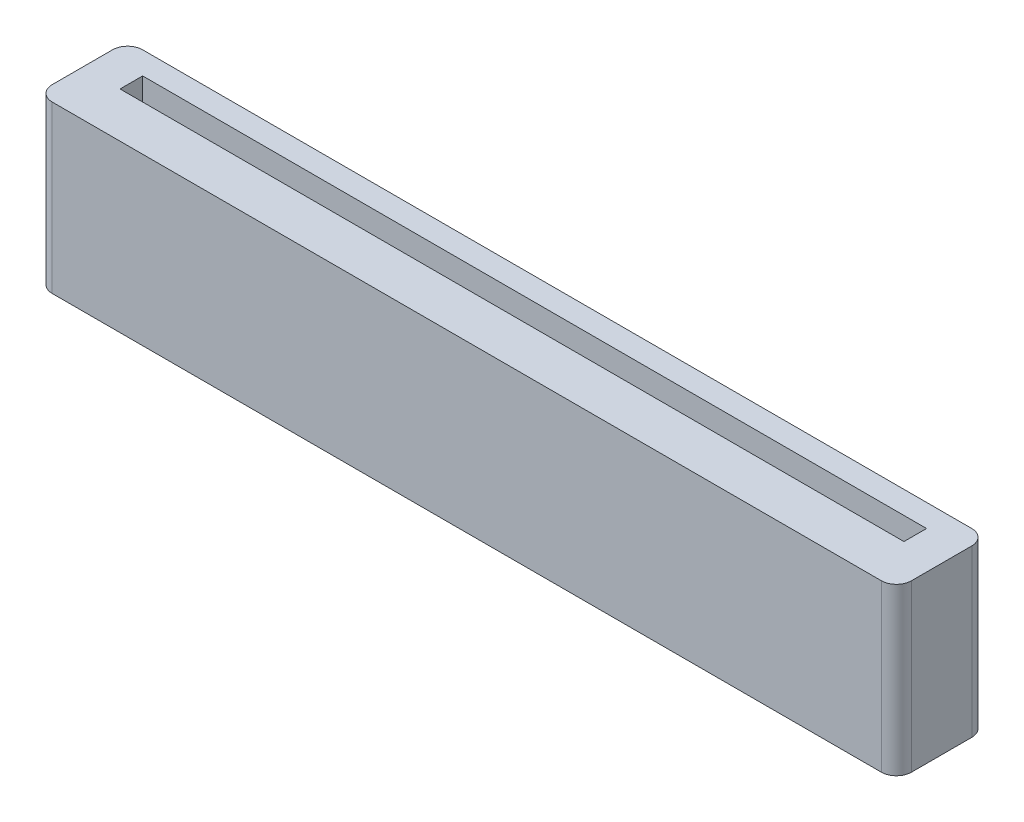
ISO-10303-21;
HEADER;
FILE_DESCRIPTION(('STEP AP214'),'2;1');
FILE_NAME('part.step','',(''),(''),'','','');
FILE_SCHEMA(('AUTOMOTIVE_DESIGN { 1 0 10303 214 1 1 1 1 }'));
ENDSEC;
DATA;
#1=APPLICATION_CONTEXT('core data for automotive mechanical design processes');
#2=APPLICATION_PROTOCOL_DEFINITION('international standard','automotive_design',2000,#1);
#3=PRODUCT_CONTEXT('',#1,'mechanical');
#4=PRODUCT('Part','Part','',(#3));
#5=PRODUCT_RELATED_PRODUCT_CATEGORY('part','',(#4));
#6=PRODUCT_DEFINITION_FORMATION('','',#4);
#7=PRODUCT_DEFINITION_CONTEXT('part definition',#1,'design');
#8=PRODUCT_DEFINITION('design','',#6,#7);
#9=PRODUCT_DEFINITION_SHAPE('','',#8);
#10=(LENGTH_UNIT() NAMED_UNIT(*) SI_UNIT(.MILLI.,.METRE.));
#11=(NAMED_UNIT(*) PLANE_ANGLE_UNIT() SI_UNIT($,.RADIAN.));
#12=(NAMED_UNIT(*) SI_UNIT($,.STERADIAN.) SOLID_ANGLE_UNIT());
#13=UNCERTAINTY_MEASURE_WITH_UNIT(LENGTH_MEASURE(1.E-05),#10,'distance_accuracy_value','');
#14=(GEOMETRIC_REPRESENTATION_CONTEXT(3) GLOBAL_UNCERTAINTY_ASSIGNED_CONTEXT((#13)) GLOBAL_UNIT_ASSIGNED_CONTEXT((#10,
#11,#12)) REPRESENTATION_CONTEXT('',''));
#15=CARTESIAN_POINT('',(0.,0.,0.));
#16=DIRECTION('',(0.,0.,1.));
#17=DIRECTION('',(1.,0.,0.));
#18=AXIS2_PLACEMENT_3D('',#15,#16,#17);
#19=CARTESIAN_POINT('',(27.5,11.,-2.));
#20=DIRECTION('',(0.,-1.,0.));
#21=DIRECTION('',(0.,0.,-1.));
#22=AXIS2_PLACEMENT_3D('',#19,#20,#21);
#23=CYLINDRICAL_SURFACE('',#22,1.);
#24=CARTESIAN_POINT('',(27.5,0.,-2.));
#25=DIRECTION('',(0.,1.,0.));
#26=DIRECTION('',(0.,0.,-1.));
#27=AXIS2_PLACEMENT_3D('',#24,#25,#26);
#28=CIRCLE('',#27,1.);
#29=CARTESIAN_POINT('',(28.5,0.,-1.99999999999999));
#30=VERTEX_POINT('',#29);
#31=CARTESIAN_POINT('',(27.5,0.,-3.));
#32=VERTEX_POINT('',#31);
#33=EDGE_CURVE('E146',#30,#32,#28,.T.);
#34=ORIENTED_EDGE('',*,*,#33,.T.);
#35=DIRECTION('',(0.,-1.,0.));
#36=VECTOR('',#35,1.);
#37=CARTESIAN_POINT('',(27.5,11.,-3.));
#38=LINE('',#37,#36);
#39=CARTESIAN_POINT('',(27.5,11.,-3.));
#40=VERTEX_POINT('',#39);
#41=EDGE_CURVE('E11',#40,#32,#38,.T.);
#42=ORIENTED_EDGE('',*,*,#41,.F.);
#43=CARTESIAN_POINT('',(27.5,11.,-2.));
#44=DIRECTION('',(0.,1.,0.));
#45=DIRECTION('',(0.,0.,-1.));
#46=AXIS2_PLACEMENT_3D('',#43,#44,#45);
#47=CIRCLE('',#46,1.);
#48=CARTESIAN_POINT('',(28.5,11.,-1.99999999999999));
#49=VERTEX_POINT('',#48);
#50=EDGE_CURVE('E162',#49,#40,#47,.T.);
#51=ORIENTED_EDGE('',*,*,#50,.F.);
#52=DIRECTION('',(0.,-1.,0.));
#53=VECTOR('',#52,1.);
#54=CARTESIAN_POINT('',(28.5,11.,-1.99999999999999));
#55=LINE('',#54,#53);
#56=EDGE_CURVE('E142',#49,#30,#55,.T.);
#57=ORIENTED_EDGE('',*,*,#56,.T.);
#58=EDGE_LOOP('',(#34,#42,#51,#57));
#59=FACE_BOUND('',#58,.T.);
#60=ADVANCED_FACE('F38',(#59),#23,.T.);
#61=CARTESIAN_POINT('',(-27.5,11.,-3.));
#62=DIRECTION('',(0.,0.,1.));
#63=DIRECTION('',(1.,0.,0.));
#64=AXIS2_PLACEMENT_3D('',#61,#62,#63);
#65=PLANE('',#64);
#66=DIRECTION('',(-1.,0.,0.));
#67=VECTOR('',#66,1.);
#68=CARTESIAN_POINT('',(-27.5,0.,-3.));
#69=LINE('',#68,#67);
#70=CARTESIAN_POINT('',(-27.5,0.,-3.));
#71=VERTEX_POINT('',#70);
#72=EDGE_CURVE('E149',#32,#71,#69,.T.);
#73=ORIENTED_EDGE('',*,*,#72,.T.);
#74=DIRECTION('',(0.,-1.,0.));
#75=VECTOR('',#74,1.);
#76=CARTESIAN_POINT('',(-27.5,11.,-3.));
#77=LINE('',#76,#75);
#78=CARTESIAN_POINT('',(-27.5,11.,-3.));
#79=VERTEX_POINT('',#78);
#80=EDGE_CURVE('E45',#79,#71,#77,.T.);
#81=ORIENTED_EDGE('',*,*,#80,.F.);
#82=DIRECTION('',(-1.,0.,0.));
#83=VECTOR('',#82,1.);
#84=CARTESIAN_POINT('',(-27.5,11.,-3.));
#85=LINE('',#84,#83);
#86=EDGE_CURVE('E102',#40,#79,#85,.T.);
#87=ORIENTED_EDGE('',*,*,#86,.F.);
#88=ORIENTED_EDGE('',*,*,#41,.T.);
#89=EDGE_LOOP('',(#73,#81,#87,#88));
#90=FACE_BOUND('',#89,.T.);
#91=ADVANCED_FACE('F265',(#90),#65,.F.);
#92=CARTESIAN_POINT('',(-27.5,11.,-2.));
#93=DIRECTION('',(0.,-1.,0.));
#94=DIRECTION('',(0.,0.,-1.));
#95=AXIS2_PLACEMENT_3D('',#92,#93,#94);
#96=CYLINDRICAL_SURFACE('',#95,1.);
#97=CARTESIAN_POINT('',(-27.5,0.,-2.));
#98=DIRECTION('',(0.,1.,0.));
#99=DIRECTION('',(0.,0.,1.));
#100=AXIS2_PLACEMENT_3D('',#97,#98,#99);
#101=CIRCLE('',#100,1.);
#102=CARTESIAN_POINT('',(-28.5,0.,-1.99999999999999));
#103=VERTEX_POINT('',#102);
#104=EDGE_CURVE('E152',#71,#103,#101,.T.);
#105=ORIENTED_EDGE('',*,*,#104,.T.);
#106=DIRECTION('',(0.,-1.,0.));
#107=VECTOR('',#106,1.);
#108=CARTESIAN_POINT('',(-28.5,11.,-1.99999999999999));
#109=LINE('',#108,#107);
#110=CARTESIAN_POINT('',(-28.5,11.,-1.99999999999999));
#111=VERTEX_POINT('',#110);
#112=EDGE_CURVE('E169',#111,#103,#109,.T.);
#113=ORIENTED_EDGE('',*,*,#112,.F.);
#114=CARTESIAN_POINT('',(-27.5,11.,-2.));
#115=DIRECTION('',(0.,1.,0.));
#116=DIRECTION('',(0.,0.,1.));
#117=AXIS2_PLACEMENT_3D('',#114,#115,#116);
#118=CIRCLE('',#117,1.);
#119=EDGE_CURVE('E177',#79,#111,#118,.T.);
#120=ORIENTED_EDGE('',*,*,#119,.F.);
#121=ORIENTED_EDGE('',*,*,#80,.T.);
#122=EDGE_LOOP('',(#105,#113,#120,#121));
#123=FACE_BOUND('',#122,.T.);
#124=ADVANCED_FACE('F175',(#123),#96,.T.);
#125=CARTESIAN_POINT('',(-28.5,11.,-1.99999999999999));
#126=DIRECTION('',(1.,0.,0.));
#127=DIRECTION('',(0.,0.,-1.));
#128=AXIS2_PLACEMENT_3D('',#125,#126,#127);
#129=PLANE('',#128);
#130=DIRECTION('',(0.,0.,1.));
#131=VECTOR('',#130,1.);
#132=CARTESIAN_POINT('',(-28.5,0.,-1.99999999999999));
#133=LINE('',#132,#131);
#134=CARTESIAN_POINT('',(-28.5,0.,1.99999999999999));
#135=VERTEX_POINT('',#134);
#136=EDGE_CURVE('E154',#103,#135,#133,.T.);
#137=ORIENTED_EDGE('',*,*,#136,.T.);
#138=DIRECTION('',(0.,-1.,0.));
#139=VECTOR('',#138,1.);
#140=CARTESIAN_POINT('',(-28.5,11.,1.99999999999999));
#141=LINE('',#140,#139);
#142=CARTESIAN_POINT('',(-28.5,11.,1.99999999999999));
#143=VERTEX_POINT('',#142);
#144=EDGE_CURVE('E166',#143,#135,#141,.T.);
#145=ORIENTED_EDGE('',*,*,#144,.F.);
#146=DIRECTION('',(0.,0.,1.));
#147=VECTOR('',#146,1.);
#148=CARTESIAN_POINT('',(-28.5,11.,-1.99999999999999));
#149=LINE('',#148,#147);
#150=EDGE_CURVE('E189',#111,#143,#149,.T.);
#151=ORIENTED_EDGE('',*,*,#150,.F.);
#152=ORIENTED_EDGE('',*,*,#112,.T.);
#153=EDGE_LOOP('',(#137,#145,#151,#152));
#154=FACE_BOUND('',#153,.T.);
#155=ADVANCED_FACE('F185',(#154),#129,.F.);
#156=CARTESIAN_POINT('',(-27.5,11.,2.));
#157=DIRECTION('',(0.,-1.,0.));
#158=DIRECTION('',(0.,0.,-1.));
#159=AXIS2_PLACEMENT_3D('',#156,#157,#158);
#160=CYLINDRICAL_SURFACE('',#159,1.);
#161=CARTESIAN_POINT('',(-27.5,0.,2.));
#162=DIRECTION('',(0.,1.,0.));
#163=DIRECTION('',(0.,0.,1.));
#164=AXIS2_PLACEMENT_3D('',#161,#162,#163);
#165=CIRCLE('',#164,1.);
#166=CARTESIAN_POINT('',(-27.5,0.,3.));
#167=VERTEX_POINT('',#166);
#168=EDGE_CURVE('E156',#135,#167,#165,.T.);
#169=ORIENTED_EDGE('',*,*,#168,.T.);
#170=DIRECTION('',(0.,-1.,0.));
#171=VECTOR('',#170,1.);
#172=CARTESIAN_POINT('',(-27.5,11.,3.));
#173=LINE('',#172,#171);
#174=CARTESIAN_POINT('',(-27.5,11.,3.));
#175=VERTEX_POINT('',#174);
#176=EDGE_CURVE('E137',#175,#167,#173,.T.);
#177=ORIENTED_EDGE('',*,*,#176,.F.);
#178=CARTESIAN_POINT('',(-27.5,11.,2.));
#179=DIRECTION('',(0.,1.,0.));
#180=DIRECTION('',(0.,0.,1.));
#181=AXIS2_PLACEMENT_3D('',#178,#179,#180);
#182=CIRCLE('',#181,1.);
#183=EDGE_CURVE('E125',#143,#175,#182,.T.);
#184=ORIENTED_EDGE('',*,*,#183,.F.);
#185=ORIENTED_EDGE('',*,*,#144,.T.);
#186=EDGE_LOOP('',(#169,#177,#184,#185));
#187=FACE_BOUND('',#186,.T.);
#188=ADVANCED_FACE('F188',(#187),#160,.T.);
#189=CARTESIAN_POINT('',(-27.5,11.,3.));
#190=DIRECTION('',(0.,0.,-1.));
#191=DIRECTION('',(-1.,0.,0.));
#192=AXIS2_PLACEMENT_3D('',#189,#190,#191);
#193=PLANE('',#192);
#194=DIRECTION('',(1.,0.,0.));
#195=VECTOR('',#194,1.);
#196=CARTESIAN_POINT('',(-27.5,0.,3.));
#197=LINE('',#196,#195);
#198=CARTESIAN_POINT('',(27.5,0.,3.));
#199=VERTEX_POINT('',#198);
#200=EDGE_CURVE('E134',#167,#199,#197,.T.);
#201=ORIENTED_EDGE('',*,*,#200,.T.);
#202=DIRECTION('',(0.,-1.,0.));
#203=VECTOR('',#202,1.);
#204=CARTESIAN_POINT('',(27.5,11.,3.));
#205=LINE('',#204,#203);
#206=CARTESIAN_POINT('',(27.5,11.,3.));
#207=VERTEX_POINT('',#206);
#208=EDGE_CURVE('E131',#207,#199,#205,.T.);
#209=ORIENTED_EDGE('',*,*,#208,.F.);
#210=DIRECTION('',(1.,0.,0.));
#211=VECTOR('',#210,1.);
#212=CARTESIAN_POINT('',(-27.5,11.,3.));
#213=LINE('',#212,#211);
#214=EDGE_CURVE('E118',#175,#207,#213,.T.);
#215=ORIENTED_EDGE('',*,*,#214,.F.);
#216=ORIENTED_EDGE('',*,*,#176,.T.);
#217=EDGE_LOOP('',(#201,#209,#215,#216));
#218=FACE_BOUND('',#217,.T.);
#219=ADVANCED_FACE('F132',(#218),#193,.F.);
#220=CARTESIAN_POINT('',(27.5,11.,2.));
#221=DIRECTION('',(0.,-1.,0.));
#222=DIRECTION('',(0.,0.,-1.));
#223=AXIS2_PLACEMENT_3D('',#220,#221,#222);
#224=CYLINDRICAL_SURFACE('',#223,1.);
#225=CARTESIAN_POINT('',(27.5,0.,2.));
#226=DIRECTION('',(0.,1.,0.));
#227=DIRECTION('',(0.,0.,1.));
#228=AXIS2_PLACEMENT_3D('',#225,#226,#227);
#229=CIRCLE('',#228,1.);
#230=CARTESIAN_POINT('',(28.5,0.,1.99999999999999));
#231=VERTEX_POINT('',#230);
#232=EDGE_CURVE('E159',#199,#231,#229,.T.);
#233=ORIENTED_EDGE('',*,*,#232,.T.);
#234=DIRECTION('',(0.,-1.,0.));
#235=VECTOR('',#234,1.);
#236=CARTESIAN_POINT('',(28.5,11.,1.99999999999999));
#237=LINE('',#236,#235);
#238=CARTESIAN_POINT('',(28.5,11.,1.99999999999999));
#239=VERTEX_POINT('',#238);
#240=EDGE_CURVE('E138',#239,#231,#237,.T.);
#241=ORIENTED_EDGE('',*,*,#240,.F.);
#242=CARTESIAN_POINT('',(27.5,11.,2.));
#243=DIRECTION('',(0.,1.,0.));
#244=DIRECTION('',(0.,0.,1.));
#245=AXIS2_PLACEMENT_3D('',#242,#243,#244);
#246=CIRCLE('',#245,1.);
#247=EDGE_CURVE('E122',#207,#239,#246,.T.);
#248=ORIENTED_EDGE('',*,*,#247,.F.);
#249=ORIENTED_EDGE('',*,*,#208,.T.);
#250=EDGE_LOOP('',(#233,#241,#248,#249));
#251=FACE_BOUND('',#250,.T.);
#252=ADVANCED_FACE('F140',(#251),#224,.T.);
#253=CARTESIAN_POINT('',(28.5,11.,-1.99999999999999));
#254=DIRECTION('',(-1.,0.,0.));
#255=DIRECTION('',(0.,0.,1.));
#256=AXIS2_PLACEMENT_3D('',#253,#254,#255);
#257=PLANE('',#256);
#258=DIRECTION('',(0.,0.,-1.));
#259=VECTOR('',#258,1.);
#260=CARTESIAN_POINT('',(28.5,0.,-1.99999999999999));
#261=LINE('',#260,#259);
#262=EDGE_CURVE('E94',#231,#30,#261,.T.);
#263=ORIENTED_EDGE('',*,*,#262,.T.);
#264=ORIENTED_EDGE('',*,*,#56,.F.);
#265=DIRECTION('',(0.,0.,-1.));
#266=VECTOR('',#265,1.);
#267=CARTESIAN_POINT('',(28.5,11.,-1.99999999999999));
#268=LINE('',#267,#266);
#269=EDGE_CURVE('E61',#239,#49,#268,.T.);
#270=ORIENTED_EDGE('',*,*,#269,.F.);
#271=ORIENTED_EDGE('',*,*,#240,.T.);
#272=EDGE_LOOP('',(#263,#264,#270,#271));
#273=FACE_BOUND('',#272,.T.);
#274=ADVANCED_FACE('F272',(#273),#257,.F.);
#275=CARTESIAN_POINT('',(27.5,11.,-2.));
#276=DIRECTION('',(0.,-1.,0.));
#277=DIRECTION('',(0.,0.,-1.));
#278=AXIS2_PLACEMENT_3D('',#275,#276,#277);
#279=PLANE('',#278);
#280=DIRECTION('',(1.,0.,0.));
#281=VECTOR('',#280,1.);
#282=CARTESIAN_POINT('',(-26.,11.,0.));
#283=LINE('',#282,#281);
#284=CARTESIAN_POINT('',(-26.,11.,0.));
#285=VERTEX_POINT('',#284);
#286=CARTESIAN_POINT('',(26.,11.,0.));
#287=VERTEX_POINT('',#286);
#288=EDGE_CURVE('E212',#285,#287,#283,.T.);
#289=ORIENTED_EDGE('',*,*,#288,.F.);
#290=DIRECTION('',(0.,0.,1.));
#291=VECTOR('',#290,1.);
#292=CARTESIAN_POINT('',(-26.,11.,-1.5));
#293=LINE('',#292,#291);
#294=CARTESIAN_POINT('',(-26.,11.,-1.5));
#295=VERTEX_POINT('',#294);
#296=EDGE_CURVE('E52',#295,#285,#293,.T.);
#297=ORIENTED_EDGE('',*,*,#296,.F.);
#298=DIRECTION('',(-1.,0.,0.));
#299=VECTOR('',#298,1.);
#300=CARTESIAN_POINT('',(-26.,11.,-1.5));
#301=LINE('',#300,#299);
#302=CARTESIAN_POINT('',(26.,11.,-1.50000000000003));
#303=VERTEX_POINT('',#302);
#304=EDGE_CURVE('E205',#303,#295,#301,.T.);
#305=ORIENTED_EDGE('',*,*,#304,.F.);
#306=DIRECTION('',(0.,0.,-1.));
#307=VECTOR('',#306,1.);
#308=CARTESIAN_POINT('',(26.,11.,-1.50000000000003));
#309=LINE('',#308,#307);
#310=EDGE_CURVE('E209',#287,#303,#309,.T.);
#311=ORIENTED_EDGE('',*,*,#310,.F.);
#312=EDGE_LOOP('',(#289,#297,#305,#311));
#313=FACE_BOUND('',#312,.T.);
#314=ORIENTED_EDGE('',*,*,#50,.T.);
#315=ORIENTED_EDGE('',*,*,#86,.T.);
#316=ORIENTED_EDGE('',*,*,#119,.T.);
#317=ORIENTED_EDGE('',*,*,#150,.T.);
#318=ORIENTED_EDGE('',*,*,#183,.T.);
#319=ORIENTED_EDGE('',*,*,#214,.T.);
#320=ORIENTED_EDGE('',*,*,#247,.T.);
#321=ORIENTED_EDGE('',*,*,#269,.T.);
#322=EDGE_LOOP('',(#314,#315,#316,#317,#318,#319,#320,#321));
#323=FACE_BOUND('',#322,.T.);
#324=ADVANCED_FACE('F120',(#313,#323),#279,.F.);
#325=CARTESIAN_POINT('',(27.5,0.,-2.));
#326=DIRECTION('',(0.,-1.,0.));
#327=DIRECTION('',(0.,0.,-1.));
#328=AXIS2_PLACEMENT_3D('',#325,#326,#327);
#329=PLANE('',#328);
#330=ORIENTED_EDGE('',*,*,#33,.F.);
#331=ORIENTED_EDGE('',*,*,#262,.F.);
#332=ORIENTED_EDGE('',*,*,#232,.F.);
#333=ORIENTED_EDGE('',*,*,#200,.F.);
#334=ORIENTED_EDGE('',*,*,#168,.F.);
#335=ORIENTED_EDGE('',*,*,#136,.F.);
#336=ORIENTED_EDGE('',*,*,#104,.F.);
#337=ORIENTED_EDGE('',*,*,#72,.F.);
#338=EDGE_LOOP('',(#330,#331,#332,#333,#334,#335,#336,#337));
#339=FACE_BOUND('',#338,.T.);
#340=ADVANCED_FACE('F181',(#339),#329,.T.);
#341=CARTESIAN_POINT('',(-26.,5.,-1.5));
#342=DIRECTION('',(-1.,0.,0.));
#343=DIRECTION('',(0.,0.,1.));
#344=AXIS2_PLACEMENT_3D('',#341,#342,#343);
#345=PLANE('',#344);
#346=ORIENTED_EDGE('',*,*,#296,.T.);
#347=DIRECTION('',(0.,1.,0.));
#348=VECTOR('',#347,1.);
#349=CARTESIAN_POINT('',(-26.,5.,0.));
#350=LINE('',#349,#348);
#351=CARTESIAN_POINT('',(-26.,5.,0.));
#352=VERTEX_POINT('',#351);
#353=EDGE_CURVE('E195',#352,#285,#350,.T.);
#354=ORIENTED_EDGE('',*,*,#353,.F.);
#355=DIRECTION('',(0.,0.,1.));
#356=VECTOR('',#355,1.);
#357=CARTESIAN_POINT('',(-26.,5.,-1.5));
#358=LINE('',#357,#356);
#359=CARTESIAN_POINT('',(-26.,5.,-1.5));
#360=VERTEX_POINT('',#359);
#361=EDGE_CURVE('E208',#360,#352,#358,.T.);
#362=ORIENTED_EDGE('',*,*,#361,.F.);
#363=DIRECTION('',(0.,1.,0.));
#364=VECTOR('',#363,1.);
#365=CARTESIAN_POINT('',(-26.,5.,-1.5));
#366=LINE('',#365,#364);
#367=EDGE_CURVE('E150',#360,#295,#366,.T.);
#368=ORIENTED_EDGE('',*,*,#367,.T.);
#369=EDGE_LOOP('',(#346,#354,#362,#368));
#370=FACE_BOUND('',#369,.T.);
#371=ADVANCED_FACE('F233',(#370),#345,.F.);
#372=CARTESIAN_POINT('',(-26.,5.,-1.5));
#373=DIRECTION('',(0.,0.,-1.));
#374=DIRECTION('',(-1.,0.,0.));
#375=AXIS2_PLACEMENT_3D('',#372,#373,#374);
#376=PLANE('',#375);
#377=ORIENTED_EDGE('',*,*,#304,.T.);
#378=ORIENTED_EDGE('',*,*,#367,.F.);
#379=DIRECTION('',(-1.,0.,0.));
#380=VECTOR('',#379,1.);
#381=CARTESIAN_POINT('',(-26.,5.,-1.5));
#382=LINE('',#381,#380);
#383=CARTESIAN_POINT('',(26.,5.,-1.50000000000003));
#384=VERTEX_POINT('',#383);
#385=EDGE_CURVE('E198',#384,#360,#382,.T.);
#386=ORIENTED_EDGE('',*,*,#385,.F.);
#387=DIRECTION('',(0.,1.,0.));
#388=VECTOR('',#387,1.);
#389=CARTESIAN_POINT('',(26.,5.,-1.50000000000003));
#390=LINE('',#389,#388);
#391=EDGE_CURVE('E201',#384,#303,#390,.T.);
#392=ORIENTED_EDGE('',*,*,#391,.T.);
#393=EDGE_LOOP('',(#377,#378,#386,#392));
#394=FACE_BOUND('',#393,.T.);
#395=ADVANCED_FACE('F244',(#394),#376,.F.);
#396=CARTESIAN_POINT('',(26.,5.,-1.50000000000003));
#397=DIRECTION('',(1.,0.,0.));
#398=DIRECTION('',(0.,0.,-1.));
#399=AXIS2_PLACEMENT_3D('',#396,#397,#398);
#400=PLANE('',#399);
#401=ORIENTED_EDGE('',*,*,#310,.T.);
#402=ORIENTED_EDGE('',*,*,#391,.F.);
#403=DIRECTION('',(0.,0.,-1.));
#404=VECTOR('',#403,1.);
#405=CARTESIAN_POINT('',(26.,5.,-1.50000000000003));
#406=LINE('',#405,#404);
#407=CARTESIAN_POINT('',(26.,5.,0.));
#408=VERTEX_POINT('',#407);
#409=EDGE_CURVE('E218',#408,#384,#406,.T.);
#410=ORIENTED_EDGE('',*,*,#409,.F.);
#411=DIRECTION('',(0.,1.,0.));
#412=VECTOR('',#411,1.);
#413=CARTESIAN_POINT('',(26.,5.,0.));
#414=LINE('',#413,#412);
#415=EDGE_CURVE('E197',#408,#287,#414,.T.);
#416=ORIENTED_EDGE('',*,*,#415,.T.);
#417=EDGE_LOOP('',(#401,#402,#410,#416));
#418=FACE_BOUND('',#417,.T.);
#419=ADVANCED_FACE('F249',(#418),#400,.F.);
#420=CARTESIAN_POINT('',(-26.,5.,0.));
#421=DIRECTION('',(0.,0.,1.));
#422=DIRECTION('',(1.,0.,0.));
#423=AXIS2_PLACEMENT_3D('',#420,#421,#422);
#424=PLANE('',#423);
#425=ORIENTED_EDGE('',*,*,#288,.T.);
#426=ORIENTED_EDGE('',*,*,#415,.F.);
#427=DIRECTION('',(1.,0.,0.));
#428=VECTOR('',#427,1.);
#429=CARTESIAN_POINT('',(-26.,5.,0.));
#430=LINE('',#429,#428);
#431=EDGE_CURVE('E221',#352,#408,#430,.T.);
#432=ORIENTED_EDGE('',*,*,#431,.F.);
#433=ORIENTED_EDGE('',*,*,#353,.T.);
#434=EDGE_LOOP('',(#425,#426,#432,#433));
#435=FACE_BOUND('',#434,.T.);
#436=ADVANCED_FACE('F254',(#435),#424,.F.);
#437=CARTESIAN_POINT('',(0.,5.,0.));
#438=DIRECTION('',(0.,1.,0.));
#439=DIRECTION('',(0.,0.,1.));
#440=AXIS2_PLACEMENT_3D('',#437,#438,#439);
#441=PLANE('',#440);
#442=ORIENTED_EDGE('',*,*,#361,.T.);
#443=ORIENTED_EDGE('',*,*,#431,.T.);
#444=ORIENTED_EDGE('',*,*,#409,.T.);
#445=ORIENTED_EDGE('',*,*,#385,.T.);
#446=EDGE_LOOP('',(#442,#443,#444,#445));
#447=FACE_BOUND('',#446,.T.);
#448=ADVANCED_FACE('F228',(#447),#441,.T.);
#449=CLOSED_SHELL('',(#60,#91,#124,#155,#188,#219,#252,#274,#324,#340,#371,#395,#419,#436,#448));
#450=MANIFOLD_SOLID_BREP('B2',#449);
#451=ADVANCED_BREP_SHAPE_REPRESENTATION('',(#18,#450),#14);
#452=SHAPE_DEFINITION_REPRESENTATION(#9,#451);
ENDSEC;
END-ISO-10303-21;
